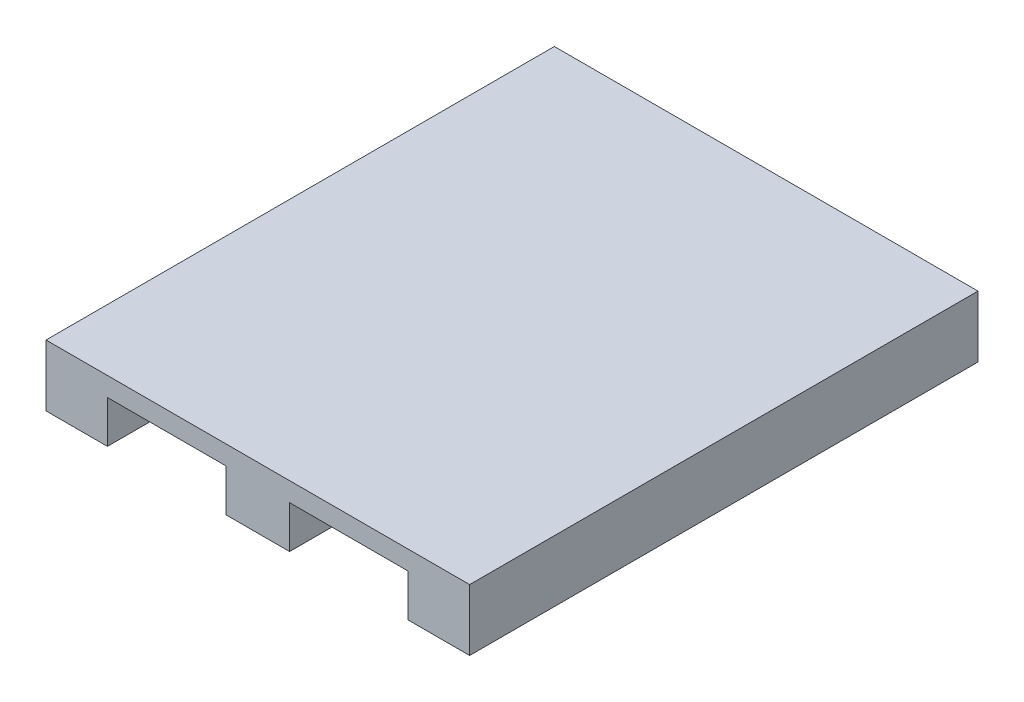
ISO-10303-21;
HEADER;
FILE_DESCRIPTION(('STEP AP214'),'2;1');
FILE_NAME('part.step','',(''),(''),'','','');
FILE_SCHEMA(('AUTOMOTIVE_DESIGN { 1 0 10303 214 1 1 1 1 }'));
ENDSEC;
DATA;
#1=APPLICATION_CONTEXT('core data for automotive mechanical design processes');
#2=APPLICATION_PROTOCOL_DEFINITION('international standard','automotive_design',2000,#1);
#3=PRODUCT_CONTEXT('',#1,'mechanical');
#4=PRODUCT('Part','Part','',(#3));
#5=PRODUCT_RELATED_PRODUCT_CATEGORY('part','',(#4));
#6=PRODUCT_DEFINITION_FORMATION('','',#4);
#7=PRODUCT_DEFINITION_CONTEXT('part definition',#1,'design');
#8=PRODUCT_DEFINITION('design','',#6,#7);
#9=PRODUCT_DEFINITION_SHAPE('','',#8);
#10=(LENGTH_UNIT() NAMED_UNIT(*) SI_UNIT(.MILLI.,.METRE.));
#11=(NAMED_UNIT(*) PLANE_ANGLE_UNIT() SI_UNIT($,.RADIAN.));
#12=(NAMED_UNIT(*) SI_UNIT($,.STERADIAN.) SOLID_ANGLE_UNIT());
#13=UNCERTAINTY_MEASURE_WITH_UNIT(LENGTH_MEASURE(1.E-05),#10,'distance_accuracy_value','');
#14=(GEOMETRIC_REPRESENTATION_CONTEXT(3) GLOBAL_UNCERTAINTY_ASSIGNED_CONTEXT((#13)) GLOBAL_UNIT_ASSIGNED_CONTEXT((#10,
#11,#12)) REPRESENTATION_CONTEXT('',''));
#15=CARTESIAN_POINT('',(0.,0.,0.));
#16=DIRECTION('',(0.,0.,1.));
#17=DIRECTION('',(1.,0.,0.));
#18=AXIS2_PLACEMENT_3D('',#15,#16,#17);
#19=CARTESIAN_POINT('',(-500.,0.,-1200.));
#20=DIRECTION('',(-1.,0.,0.));
#21=DIRECTION('',(0.,0.,1.));
#22=AXIS2_PLACEMENT_3D('',#19,#20,#21);
#23=PLANE('',#22);
#24=DIRECTION('',(0.,-1.,0.));
#25=VECTOR('',#24,1.);
#26=CARTESIAN_POINT('',(-500.,0.,0.));
#27=LINE('',#26,#25);
#28=CARTESIAN_POINT('',(-500.,145.,0.));
#29=VERTEX_POINT('',#28);
#30=CARTESIAN_POINT('',(-500.,0.,0.));
#31=VERTEX_POINT('',#30);
#32=EDGE_CURVE('E152',#29,#31,#27,.T.);
#33=ORIENTED_EDGE('',*,*,#32,.F.);
#34=DIRECTION('',(0.,0.,1.));
#35=VECTOR('',#34,1.);
#36=CARTESIAN_POINT('',(-500.,145.,-1200.));
#37=LINE('',#36,#35);
#38=CARTESIAN_POINT('',(-500.,145.,-1200.));
#39=VERTEX_POINT('',#38);
#40=EDGE_CURVE('E11',#39,#29,#37,.T.);
#41=ORIENTED_EDGE('',*,*,#40,.F.);
#42=DIRECTION('',(0.,-1.,0.));
#43=VECTOR('',#42,1.);
#44=CARTESIAN_POINT('',(-500.,0.,-1200.));
#45=LINE('',#44,#43);
#46=CARTESIAN_POINT('',(-500.,0.,-1200.));
#47=VERTEX_POINT('',#46);
#48=EDGE_CURVE('E184',#39,#47,#45,.T.);
#49=ORIENTED_EDGE('',*,*,#48,.T.);
#50=DIRECTION('',(0.,0.,1.));
#51=VECTOR('',#50,1.);
#52=CARTESIAN_POINT('',(-500.,0.,-1200.));
#53=LINE('',#52,#51);
#54=EDGE_CURVE('E34',#47,#31,#53,.T.);
#55=ORIENTED_EDGE('',*,*,#54,.T.);
#56=EDGE_LOOP('',(#33,#41,#49,#55));
#57=FACE_BOUND('',#56,.T.);
#58=ADVANCED_FACE('F31',(#57),#23,.T.);
#59=CARTESIAN_POINT('',(-500.,145.,-1200.));
#60=DIRECTION('',(0.,1.,0.));
#61=DIRECTION('',(0.,0.,1.));
#62=AXIS2_PLACEMENT_3D('',#59,#60,#61);
#63=PLANE('',#62);
#64=DIRECTION('',(-1.,0.,0.));
#65=VECTOR('',#64,1.);
#66=CARTESIAN_POINT('',(-500.,145.,0.));
#67=LINE('',#66,#65);
#68=CARTESIAN_POINT('',(500.,145.,0.));
#69=VERTEX_POINT('',#68);
#70=EDGE_CURVE('E182',#69,#29,#67,.T.);
#71=ORIENTED_EDGE('',*,*,#70,.F.);
#72=DIRECTION('',(0.,0.,1.));
#73=VECTOR('',#72,1.);
#74=CARTESIAN_POINT('',(500.,145.,-1200.));
#75=LINE('',#74,#73);
#76=CARTESIAN_POINT('',(500.,145.,-1200.));
#77=VERTEX_POINT('',#76);
#78=EDGE_CURVE('E40',#77,#69,#75,.T.);
#79=ORIENTED_EDGE('',*,*,#78,.F.);
#80=DIRECTION('',(-1.,0.,0.));
#81=VECTOR('',#80,1.);
#82=CARTESIAN_POINT('',(-500.,145.,-1200.));
#83=LINE('',#82,#81);
#84=EDGE_CURVE('E142',#77,#39,#83,.T.);
#85=ORIENTED_EDGE('',*,*,#84,.T.);
#86=ORIENTED_EDGE('',*,*,#40,.T.);
#87=EDGE_LOOP('',(#71,#79,#85,#86));
#88=FACE_BOUND('',#87,.T.);
#89=ADVANCED_FACE('F204',(#88),#63,.T.);
#90=CARTESIAN_POINT('',(500.,0.,-1200.));
#91=DIRECTION('',(1.,0.,0.));
#92=DIRECTION('',(0.,0.,-1.));
#93=AXIS2_PLACEMENT_3D('',#90,#91,#92);
#94=PLANE('',#93);
#95=DIRECTION('',(0.,1.,0.));
#96=VECTOR('',#95,1.);
#97=CARTESIAN_POINT('',(500.,0.,0.));
#98=LINE('',#97,#96);
#99=CARTESIAN_POINT('',(500.,0.,0.));
#100=VERTEX_POINT('',#99);
#101=EDGE_CURVE('E129',#100,#69,#98,.T.);
#102=ORIENTED_EDGE('',*,*,#101,.F.);
#103=DIRECTION('',(0.,0.,1.));
#104=VECTOR('',#103,1.);
#105=CARTESIAN_POINT('',(500.,0.,-1200.));
#106=LINE('',#105,#104);
#107=CARTESIAN_POINT('',(500.,0.,-1200.));
#108=VERTEX_POINT('',#107);
#109=EDGE_CURVE('E124',#108,#100,#106,.T.);
#110=ORIENTED_EDGE('',*,*,#109,.F.);
#111=DIRECTION('',(0.,1.,0.));
#112=VECTOR('',#111,1.);
#113=CARTESIAN_POINT('',(500.,0.,-1200.));
#114=LINE('',#113,#112);
#115=EDGE_CURVE('E127',#108,#77,#114,.T.);
#116=ORIENTED_EDGE('',*,*,#115,.T.);
#117=ORIENTED_EDGE('',*,*,#78,.T.);
#118=EDGE_LOOP('',(#102,#110,#116,#117));
#119=FACE_BOUND('',#118,.T.);
#120=ADVANCED_FACE('F126',(#119),#94,.T.);
#121=CARTESIAN_POINT('',(355.,0.,-1200.));
#122=DIRECTION('',(0.,-1.,0.));
#123=DIRECTION('',(0.,0.,-1.));
#124=AXIS2_PLACEMENT_3D('',#121,#122,#123);
#125=PLANE('',#124);
#126=DIRECTION('',(1.,0.,0.));
#127=VECTOR('',#126,1.);
#128=CARTESIAN_POINT('',(355.,0.,0.));
#129=LINE('',#128,#127);
#130=CARTESIAN_POINT('',(355.,0.,0.));
#131=VERTEX_POINT('',#130);
#132=EDGE_CURVE('E179',#131,#100,#129,.T.);
#133=ORIENTED_EDGE('',*,*,#132,.F.);
#134=DIRECTION('',(0.,0.,1.));
#135=VECTOR('',#134,1.);
#136=CARTESIAN_POINT('',(355.,0.,-1200.));
#137=LINE('',#136,#135);
#138=CARTESIAN_POINT('',(355.,0.,-1200.));
#139=VERTEX_POINT('',#138);
#140=EDGE_CURVE('E134',#139,#131,#137,.T.);
#141=ORIENTED_EDGE('',*,*,#140,.F.);
#142=DIRECTION('',(1.,0.,0.));
#143=VECTOR('',#142,1.);
#144=CARTESIAN_POINT('',(355.,0.,-1200.));
#145=LINE('',#144,#143);
#146=EDGE_CURVE('E140',#139,#108,#145,.T.);
#147=ORIENTED_EDGE('',*,*,#146,.T.);
#148=ORIENTED_EDGE('',*,*,#109,.T.);
#149=EDGE_LOOP('',(#133,#141,#147,#148));
#150=FACE_BOUND('',#149,.T.);
#151=ADVANCED_FACE('F144',(#150),#125,.T.);
#152=CARTESIAN_POINT('',(355.,0.,-1200.));
#153=DIRECTION('',(-1.,0.,0.));
#154=DIRECTION('',(0.,0.,1.));
#155=AXIS2_PLACEMENT_3D('',#152,#153,#154);
#156=PLANE('',#155);
#157=DIRECTION('',(0.,-1.,0.));
#158=VECTOR('',#157,1.);
#159=CARTESIAN_POINT('',(355.,0.,0.));
#160=LINE('',#159,#158);
#161=CARTESIAN_POINT('',(355.,100.,0.));
#162=VERTEX_POINT('',#161);
#163=EDGE_CURVE('E176',#162,#131,#160,.T.);
#164=ORIENTED_EDGE('',*,*,#163,.F.);
#165=DIRECTION('',(0.,0.,1.));
#166=VECTOR('',#165,1.);
#167=CARTESIAN_POINT('',(355.,100.,-1200.));
#168=LINE('',#167,#166);
#169=CARTESIAN_POINT('',(355.,100.,-1200.));
#170=VERTEX_POINT('',#169);
#171=EDGE_CURVE('E188',#170,#162,#168,.T.);
#172=ORIENTED_EDGE('',*,*,#171,.F.);
#173=DIRECTION('',(0.,-1.,0.));
#174=VECTOR('',#173,1.);
#175=CARTESIAN_POINT('',(355.,0.,-1200.));
#176=LINE('',#175,#174);
#177=EDGE_CURVE('E145',#170,#139,#176,.T.);
#178=ORIENTED_EDGE('',*,*,#177,.T.);
#179=ORIENTED_EDGE('',*,*,#140,.T.);
#180=EDGE_LOOP('',(#164,#172,#178,#179));
#181=FACE_BOUND('',#180,.T.);
#182=ADVANCED_FACE('F217',(#181),#156,.T.);
#183=CARTESIAN_POINT('',(355.,100.,-1200.));
#184=DIRECTION('',(0.,-1.,0.));
#185=DIRECTION('',(0.,0.,-1.));
#186=AXIS2_PLACEMENT_3D('',#183,#184,#185);
#187=PLANE('',#186);
#188=DIRECTION('',(1.,0.,0.));
#189=VECTOR('',#188,1.);
#190=CARTESIAN_POINT('',(355.,100.,0.));
#191=LINE('',#190,#189);
#192=CARTESIAN_POINT('',(75.,100.,0.));
#193=VERTEX_POINT('',#192);
#194=EDGE_CURVE('E173',#193,#162,#191,.T.);
#195=ORIENTED_EDGE('',*,*,#194,.F.);
#196=DIRECTION('',(0.,0.,1.));
#197=VECTOR('',#196,1.);
#198=CARTESIAN_POINT('',(75.,100.,-1200.));
#199=LINE('',#198,#197);
#200=CARTESIAN_POINT('',(75.,100.,-1200.));
#201=VERTEX_POINT('',#200);
#202=EDGE_CURVE('E190',#201,#193,#199,.T.);
#203=ORIENTED_EDGE('',*,*,#202,.F.);
#204=DIRECTION('',(1.,0.,0.));
#205=VECTOR('',#204,1.);
#206=CARTESIAN_POINT('',(355.,100.,-1200.));
#207=LINE('',#206,#205);
#208=EDGE_CURVE('E147',#201,#170,#207,.T.);
#209=ORIENTED_EDGE('',*,*,#208,.T.);
#210=ORIENTED_EDGE('',*,*,#171,.T.);
#211=EDGE_LOOP('',(#195,#203,#209,#210));
#212=FACE_BOUND('',#211,.T.);
#213=ADVANCED_FACE('F220',(#212),#187,.T.);
#214=CARTESIAN_POINT('',(75.,100.,-1200.));
#215=DIRECTION('',(1.,0.,0.));
#216=DIRECTION('',(0.,1.,0.));
#217=AXIS2_PLACEMENT_3D('',#214,#215,#216);
#218=PLANE('',#217);
#219=DIRECTION('',(0.,1.,0.));
#220=VECTOR('',#219,1.);
#221=CARTESIAN_POINT('',(75.,100.,0.));
#222=LINE('',#221,#220);
#223=CARTESIAN_POINT('',(74.9999999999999,0.,0.));
#224=VERTEX_POINT('',#223);
#225=EDGE_CURVE('E170',#224,#193,#222,.T.);
#226=ORIENTED_EDGE('',*,*,#225,.F.);
#227=DIRECTION('',(0.,0.,1.));
#228=VECTOR('',#227,1.);
#229=CARTESIAN_POINT('',(74.9999999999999,0.,-1200.));
#230=LINE('',#229,#228);
#231=CARTESIAN_POINT('',(74.9999999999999,0.,-1200.));
#232=VERTEX_POINT('',#231);
#233=EDGE_CURVE('E192',#232,#224,#230,.T.);
#234=ORIENTED_EDGE('',*,*,#233,.F.);
#235=DIRECTION('',(0.,1.,0.));
#236=VECTOR('',#235,1.);
#237=CARTESIAN_POINT('',(75.,100.,-1200.));
#238=LINE('',#237,#236);
#239=EDGE_CURVE('E346',#232,#201,#238,.T.);
#240=ORIENTED_EDGE('',*,*,#239,.T.);
#241=ORIENTED_EDGE('',*,*,#202,.T.);
#242=EDGE_LOOP('',(#226,#234,#240,#241));
#243=FACE_BOUND('',#242,.T.);
#244=ADVANCED_FACE('F224',(#243),#218,.T.);
#245=CARTESIAN_POINT('',(-74.9999999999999,0.,-1200.));
#246=DIRECTION('',(0.,-1.,0.));
#247=DIRECTION('',(0.,0.,-1.));
#248=AXIS2_PLACEMENT_3D('',#245,#246,#247);
#249=PLANE('',#248);
#250=DIRECTION('',(1.,0.,0.));
#251=VECTOR('',#250,1.);
#252=CARTESIAN_POINT('',(-74.9999999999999,0.,0.));
#253=LINE('',#252,#251);
#254=CARTESIAN_POINT('',(-74.9999999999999,0.,0.));
#255=VERTEX_POINT('',#254);
#256=EDGE_CURVE('E167',#255,#224,#253,.T.);
#257=ORIENTED_EDGE('',*,*,#256,.F.);
#258=DIRECTION('',(0.,0.,1.));
#259=VECTOR('',#258,1.);
#260=CARTESIAN_POINT('',(-74.9999999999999,0.,-1200.));
#261=LINE('',#260,#259);
#262=CARTESIAN_POINT('',(-74.9999999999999,0.,-1200.));
#263=VERTEX_POINT('',#262);
#264=EDGE_CURVE('E194',#263,#255,#261,.T.);
#265=ORIENTED_EDGE('',*,*,#264,.F.);
#266=DIRECTION('',(1.,0.,0.));
#267=VECTOR('',#266,1.);
#268=CARTESIAN_POINT('',(-74.9999999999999,0.,-1200.));
#269=LINE('',#268,#267);
#270=EDGE_CURVE('E350',#263,#232,#269,.T.);
#271=ORIENTED_EDGE('',*,*,#270,.T.);
#272=ORIENTED_EDGE('',*,*,#233,.T.);
#273=EDGE_LOOP('',(#257,#265,#271,#272));
#274=FACE_BOUND('',#273,.T.);
#275=ADVANCED_FACE('F228',(#274),#249,.T.);
#276=CARTESIAN_POINT('',(-75.,100.,-1200.));
#277=DIRECTION('',(-1.,0.,0.));
#278=DIRECTION('',(0.,-1.,0.));
#279=AXIS2_PLACEMENT_3D('',#276,#277,#278);
#280=PLANE('',#279);
#281=DIRECTION('',(0.,-1.,0.));
#282=VECTOR('',#281,1.);
#283=CARTESIAN_POINT('',(-75.,100.,0.));
#284=LINE('',#283,#282);
#285=CARTESIAN_POINT('',(-75.,100.,0.));
#286=VERTEX_POINT('',#285);
#287=EDGE_CURVE('E164',#286,#255,#284,.T.);
#288=ORIENTED_EDGE('',*,*,#287,.F.);
#289=DIRECTION('',(0.,0.,1.));
#290=VECTOR('',#289,1.);
#291=CARTESIAN_POINT('',(-75.,100.,-1200.));
#292=LINE('',#291,#290);
#293=CARTESIAN_POINT('',(-75.,100.,-1200.));
#294=VERTEX_POINT('',#293);
#295=EDGE_CURVE('E196',#294,#286,#292,.T.);
#296=ORIENTED_EDGE('',*,*,#295,.F.);
#297=DIRECTION('',(0.,-1.,0.));
#298=VECTOR('',#297,1.);
#299=CARTESIAN_POINT('',(-75.,100.,-1200.));
#300=LINE('',#299,#298);
#301=EDGE_CURVE('E339',#294,#263,#300,.T.);
#302=ORIENTED_EDGE('',*,*,#301,.T.);
#303=ORIENTED_EDGE('',*,*,#264,.T.);
#304=EDGE_LOOP('',(#288,#296,#302,#303));
#305=FACE_BOUND('',#304,.T.);
#306=ADVANCED_FACE('F232',(#305),#280,.T.);
#307=CARTESIAN_POINT('',(-355.,100.,-1200.));
#308=DIRECTION('',(0.,-1.,0.));
#309=DIRECTION('',(0.,0.,-1.));
#310=AXIS2_PLACEMENT_3D('',#307,#308,#309);
#311=PLANE('',#310);
#312=DIRECTION('',(1.,0.,0.));
#313=VECTOR('',#312,1.);
#314=CARTESIAN_POINT('',(-355.,100.,0.));
#315=LINE('',#314,#313);
#316=CARTESIAN_POINT('',(-355.,100.,0.));
#317=VERTEX_POINT('',#316);
#318=EDGE_CURVE('E161',#317,#286,#315,.T.);
#319=ORIENTED_EDGE('',*,*,#318,.F.);
#320=DIRECTION('',(0.,0.,1.));
#321=VECTOR('',#320,1.);
#322=CARTESIAN_POINT('',(-355.,100.,-1200.));
#323=LINE('',#322,#321);
#324=CARTESIAN_POINT('',(-355.,100.,-1200.));
#325=VERTEX_POINT('',#324);
#326=EDGE_CURVE('E198',#325,#317,#323,.T.);
#327=ORIENTED_EDGE('',*,*,#326,.F.);
#328=DIRECTION('',(1.,0.,0.));
#329=VECTOR('',#328,1.);
#330=CARTESIAN_POINT('',(-355.,100.,-1200.));
#331=LINE('',#330,#329);
#332=EDGE_CURVE('E335',#325,#294,#331,.T.);
#333=ORIENTED_EDGE('',*,*,#332,.T.);
#334=ORIENTED_EDGE('',*,*,#295,.T.);
#335=EDGE_LOOP('',(#319,#327,#333,#334));
#336=FACE_BOUND('',#335,.T.);
#337=ADVANCED_FACE('F236',(#336),#311,.T.);
#338=CARTESIAN_POINT('',(-355.,0.,-1200.));
#339=DIRECTION('',(1.,0.,0.));
#340=DIRECTION('',(0.,0.,-1.));
#341=AXIS2_PLACEMENT_3D('',#338,#339,#340);
#342=PLANE('',#341);
#343=DIRECTION('',(0.,1.,0.));
#344=VECTOR('',#343,1.);
#345=CARTESIAN_POINT('',(-355.,0.,0.));
#346=LINE('',#345,#344);
#347=CARTESIAN_POINT('',(-355.,0.,0.));
#348=VERTEX_POINT('',#347);
#349=EDGE_CURVE('E158',#348,#317,#346,.T.);
#350=ORIENTED_EDGE('',*,*,#349,.F.);
#351=DIRECTION('',(0.,0.,1.));
#352=VECTOR('',#351,1.);
#353=CARTESIAN_POINT('',(-355.,0.,-1200.));
#354=LINE('',#353,#352);
#355=CARTESIAN_POINT('',(-355.,0.,-1200.));
#356=VERTEX_POINT('',#355);
#357=EDGE_CURVE('E199',#356,#348,#354,.T.);
#358=ORIENTED_EDGE('',*,*,#357,.F.);
#359=DIRECTION('',(0.,1.,0.));
#360=VECTOR('',#359,1.);
#361=CARTESIAN_POINT('',(-355.,0.,-1200.));
#362=LINE('',#361,#360);
#363=EDGE_CURVE('E356',#356,#325,#362,.T.);
#364=ORIENTED_EDGE('',*,*,#363,.T.);
#365=ORIENTED_EDGE('',*,*,#326,.T.);
#366=EDGE_LOOP('',(#350,#358,#364,#365));
#367=FACE_BOUND('',#366,.T.);
#368=ADVANCED_FACE('F240',(#367),#342,.T.);
#369=CARTESIAN_POINT('',(-500.,0.,-1200.));
#370=DIRECTION('',(0.,-1.,0.));
#371=DIRECTION('',(0.,0.,-1.));
#372=AXIS2_PLACEMENT_3D('',#369,#370,#371);
#373=PLANE('',#372);
#374=DIRECTION('',(1.,0.,0.));
#375=VECTOR('',#374,1.);
#376=CARTESIAN_POINT('',(-500.,0.,0.));
#377=LINE('',#376,#375);
#378=EDGE_CURVE('E155',#31,#348,#377,.T.);
#379=ORIENTED_EDGE('',*,*,#378,.F.);
#380=ORIENTED_EDGE('',*,*,#54,.F.);
#381=DIRECTION('',(1.,0.,0.));
#382=VECTOR('',#381,1.);
#383=CARTESIAN_POINT('',(-500.,0.,-1200.));
#384=LINE('',#383,#382);
#385=EDGE_CURVE('E358',#47,#356,#384,.T.);
#386=ORIENTED_EDGE('',*,*,#385,.T.);
#387=ORIENTED_EDGE('',*,*,#357,.T.);
#388=EDGE_LOOP('',(#379,#380,#386,#387));
#389=FACE_BOUND('',#388,.T.);
#390=ADVANCED_FACE('F201',(#389),#373,.T.);
#391=CARTESIAN_POINT('',(-500.,145.,-1200.));
#392=DIRECTION('',(0.,0.,-1.));
#393=DIRECTION('',(-1.,0.,0.));
#394=AXIS2_PLACEMENT_3D('',#391,#392,#393);
#395=PLANE('',#394);
#396=ORIENTED_EDGE('',*,*,#48,.F.);
#397=ORIENTED_EDGE('',*,*,#84,.F.);
#398=ORIENTED_EDGE('',*,*,#115,.F.);
#399=ORIENTED_EDGE('',*,*,#146,.F.);
#400=ORIENTED_EDGE('',*,*,#177,.F.);
#401=ORIENTED_EDGE('',*,*,#208,.F.);
#402=ORIENTED_EDGE('',*,*,#239,.F.);
#403=ORIENTED_EDGE('',*,*,#270,.F.);
#404=ORIENTED_EDGE('',*,*,#301,.F.);
#405=ORIENTED_EDGE('',*,*,#332,.F.);
#406=ORIENTED_EDGE('',*,*,#363,.F.);
#407=ORIENTED_EDGE('',*,*,#385,.F.);
#408=EDGE_LOOP('',(#396,#397,#398,#399,#400,#401,#402,#403,#404,#405,#406,#407));
#409=FACE_BOUND('',#408,.T.);
#410=ADVANCED_FACE('F138',(#409),#395,.T.);
#411=CARTESIAN_POINT('',(-500.,145.,0.));
#412=DIRECTION('',(0.,0.,-1.));
#413=DIRECTION('',(-1.,0.,0.));
#414=AXIS2_PLACEMENT_3D('',#411,#412,#413);
#415=PLANE('',#414);
#416=ORIENTED_EDGE('',*,*,#32,.T.);
#417=ORIENTED_EDGE('',*,*,#378,.T.);
#418=ORIENTED_EDGE('',*,*,#349,.T.);
#419=ORIENTED_EDGE('',*,*,#318,.T.);
#420=ORIENTED_EDGE('',*,*,#287,.T.);
#421=ORIENTED_EDGE('',*,*,#256,.T.);
#422=ORIENTED_EDGE('',*,*,#225,.T.);
#423=ORIENTED_EDGE('',*,*,#194,.T.);
#424=ORIENTED_EDGE('',*,*,#163,.T.);
#425=ORIENTED_EDGE('',*,*,#132,.T.);
#426=ORIENTED_EDGE('',*,*,#101,.T.);
#427=ORIENTED_EDGE('',*,*,#70,.T.);
#428=EDGE_LOOP('',(#416,#417,#418,#419,#420,#421,#422,#423,#424,#425,#426,#427));
#429=FACE_BOUND('',#428,.T.);
#430=ADVANCED_FACE('F203',(#429),#415,.F.);
#431=CLOSED_SHELL('',(#58,#89,#120,#151,#182,#213,#244,#275,#306,#337,#368,#390,#410,#430));
#432=MANIFOLD_SOLID_BREP('B2',#431);
#433=ADVANCED_BREP_SHAPE_REPRESENTATION('',(#18,#432),#14);
#434=SHAPE_DEFINITION_REPRESENTATION(#9,#433);
ENDSEC;
END-ISO-10303-21;
